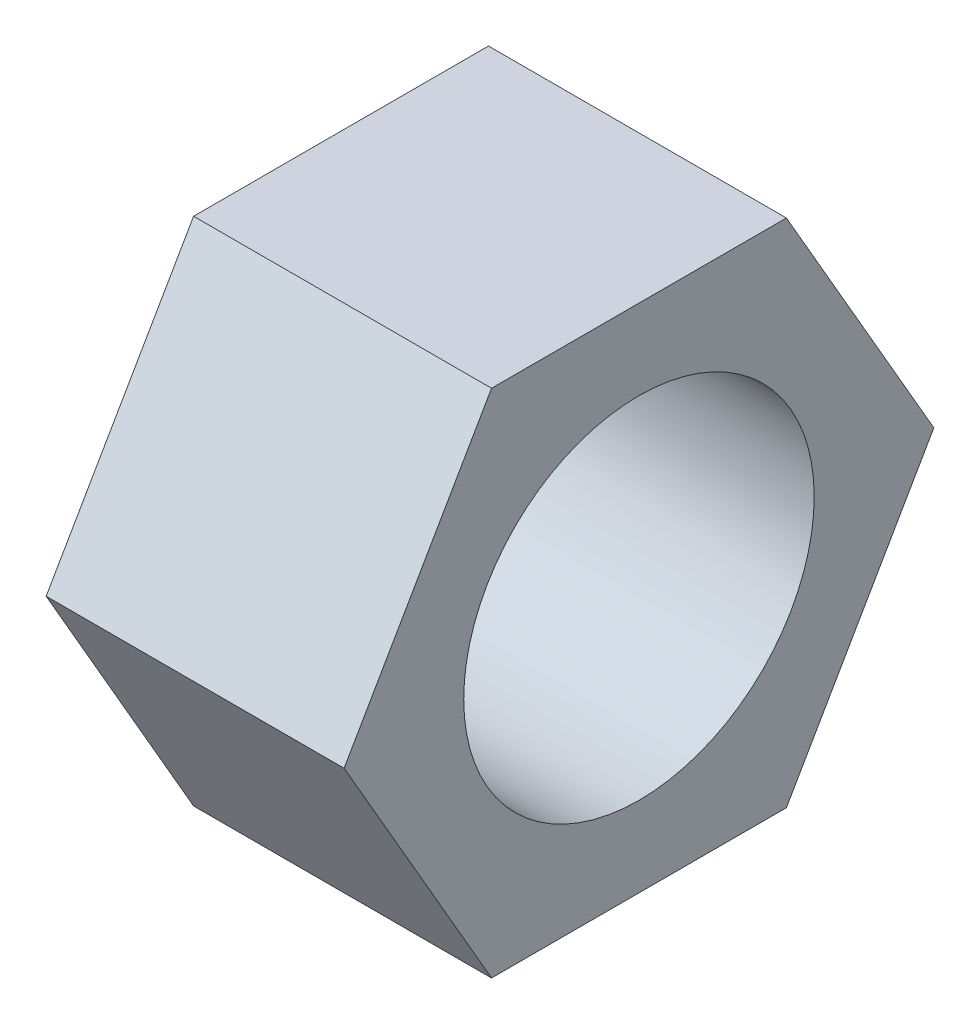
from build123d import *

# Parameters (mm, degrees)
BOSS_EXTRUDE1_DEPTH     = 8.334375
F_3_8_CLEARANCE_HOLE1_D = 9.8044


with BuildPart() as part:
    # Sketch1 → Boss-Extrude1 (new body)
    with BuildSketch(Plane(origin=(0, 0, 0), x_dir=(0, 0, -1), z_dir=(1, 0, 0))):
        Polygon((4.124445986, 7.14375), (-4.124445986, 7.14375), (-8.248891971, 0), (-4.124445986, -7.14375), (4.124445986, -7.14375), (8.248891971, 0), align=None)
    extrude(amount=BOSS_EXTRUDE1_DEPTH)

    # 3_8 Clearance Hole1 (through all)
    with Locations(Plane(origin=(8.334375, 0, 0), x_dir=(0, 0, -1), z_dir=(1, 0, 0))):
        with Locations((0, 0)):
            Hole(F_3_8_CLEARANCE_HOLE1_D / 2)


solid = part.part
